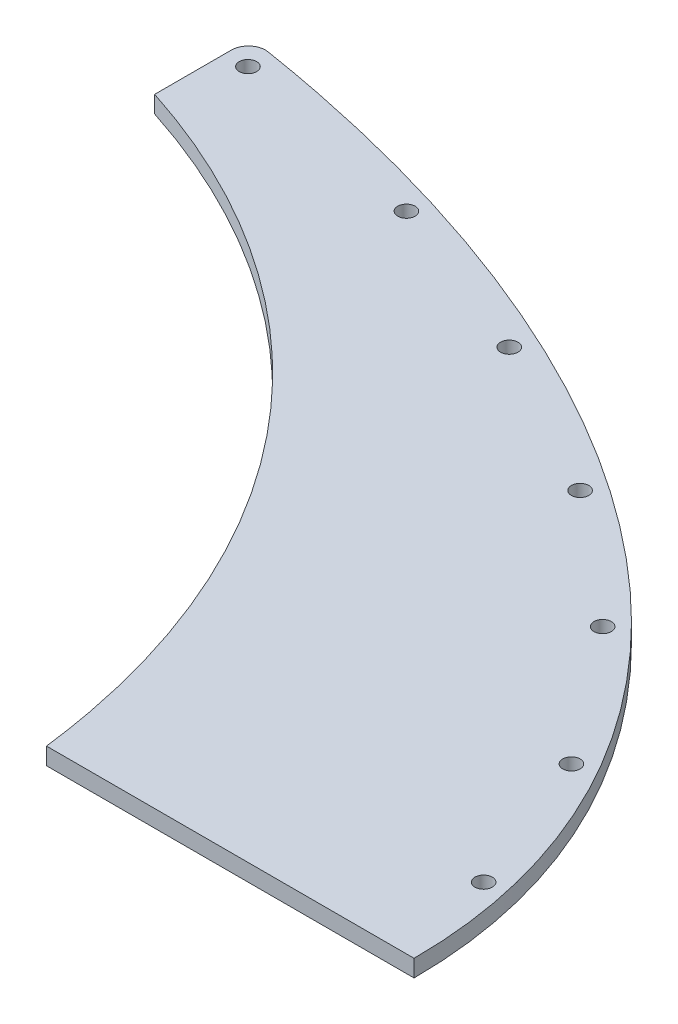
from build123d import *

# Parameters (mm, degrees)
SKETCH1_R      = 3.2385
EXTRUDE1_DEPTH = 6.35


with BuildPart() as part:
    # Sketch1 → Extrude1 (new body)
    with BuildSketch(Plane(origin=(0, 0, 0), x_dir=(1, 0, 0), z_dir=(0, 1, 0))):
        with BuildLine():
            Line((0, 0), (-136.656257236, 0))
            add(Edge.make_bspline(
                [(-136.656257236, 0), (-158.104208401, 175.407999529), (-326.39, 229.959942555)],
                knots=[5.771158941, 5.771158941, 5.771158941, 6.805675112, 6.805675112, 6.805675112], degree=2, weights=[1, 0.869178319, 1]))
            Line((-326.39, 229.959942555), (-326.39, 258.449466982))
            ThreePointArc((-326.39, 258.449466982), (-324.160018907, 263.28143803), (-319.036316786, 264.719644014))
            add(Edge.make_bspline(
                [(0, 0), (0, 213.650687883), (-319.036316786, 264.719644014)],
                knots=[0, 0, 0, 1.329429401, 1.329429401, 1.329429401], degree=2, weights=[1, 0.7870928, 1]))
        make_face()
        with Locations(Location((-317.97732508, 256.219418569, 0), (0, 0, 270))):
            Circle(SKETCH1_R, mode=Mode.SUBTRACT)
        with Locations(Location((-241.961093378, 239.126548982, 0), (0, 0, 270))):
            Circle(SKETCH1_R, mode=Mode.SUBTRACT)
        with Locations(Location((-179.060738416, 214.456330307, 0), (0, 0, 270))):
            Circle(SKETCH1_R, mode=Mode.SUBTRACT)
        with Locations(Location((-119.757513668, 181.49749424, 0), (0, 0, 270))):
            Circle(SKETCH1_R, mode=Mode.SUBTRACT)
        with Locations(Location((-71.742243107, 141.85993661, 0), (0, 0, 270))):
            Circle(SKETCH1_R, mode=Mode.SUBTRACT)
        with Locations(Location((-33.318153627, 91.826072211, 0), (0, 0, 270))):
            Circle(SKETCH1_R, mode=Mode.SUBTRACT)
        with Locations(Location((-11.578077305, 37.44023721, 0), (0, 0, 270))):
            Circle(SKETCH1_R, mode=Mode.SUBTRACT)
    extrude(amount=EXTRUDE1_DEPTH)


solid = part.part
